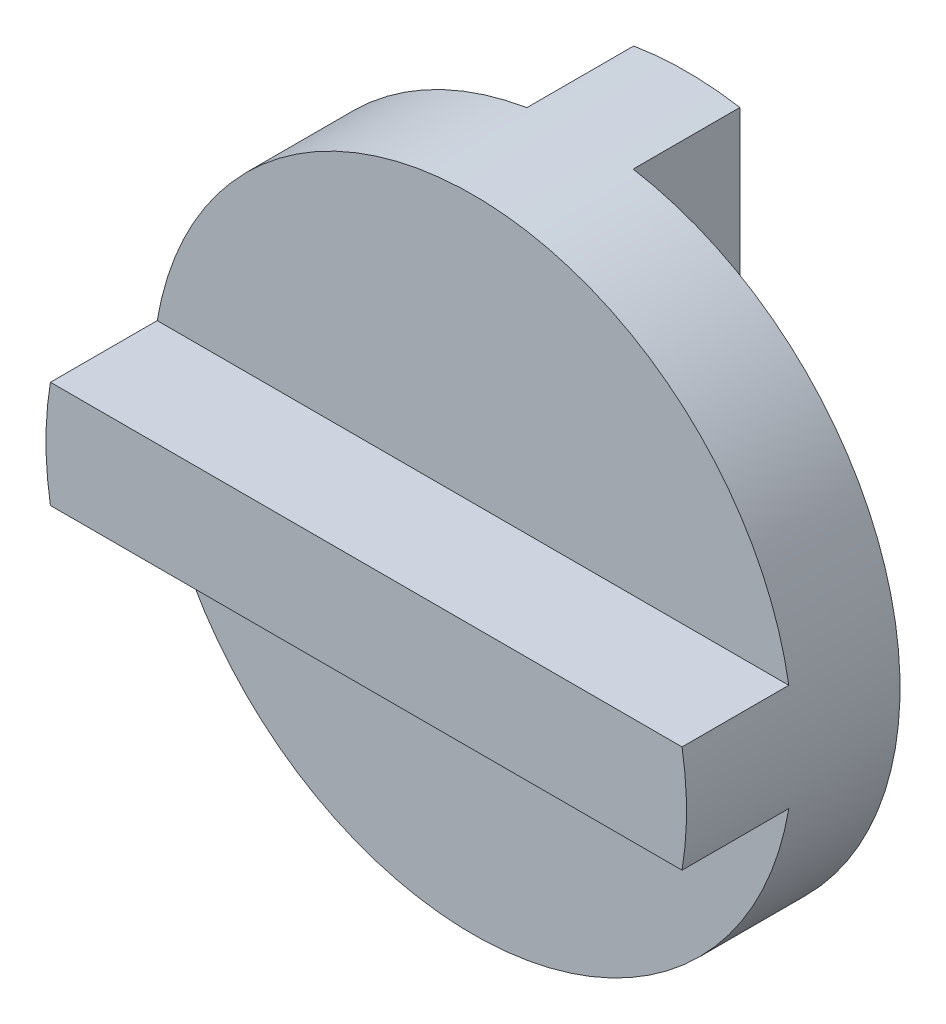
ISO-10303-21;
HEADER;
FILE_DESCRIPTION(('STEP AP214'),'2;1');
FILE_NAME('part.step','',(''),(''),'','','');
FILE_SCHEMA(('AUTOMOTIVE_DESIGN { 1 0 10303 214 1 1 1 1 }'));
ENDSEC;
DATA;
#1=APPLICATION_CONTEXT('core data for automotive mechanical design processes');
#2=APPLICATION_PROTOCOL_DEFINITION('international standard','automotive_design',2000,#1);
#3=PRODUCT_CONTEXT('',#1,'mechanical');
#4=PRODUCT('Part','Part','',(#3));
#5=PRODUCT_RELATED_PRODUCT_CATEGORY('part','',(#4));
#6=PRODUCT_DEFINITION_FORMATION('','',#4);
#7=PRODUCT_DEFINITION_CONTEXT('part definition',#1,'design');
#8=PRODUCT_DEFINITION('design','',#6,#7);
#9=PRODUCT_DEFINITION_SHAPE('','',#8);
#10=(LENGTH_UNIT() NAMED_UNIT(*) SI_UNIT(.MILLI.,.METRE.));
#11=(NAMED_UNIT(*) PLANE_ANGLE_UNIT() SI_UNIT($,.RADIAN.));
#12=(NAMED_UNIT(*) SI_UNIT($,.STERADIAN.) SOLID_ANGLE_UNIT());
#13=UNCERTAINTY_MEASURE_WITH_UNIT(LENGTH_MEASURE(1.E-05),#10,'distance_accuracy_value','');
#14=(GEOMETRIC_REPRESENTATION_CONTEXT(3) GLOBAL_UNCERTAINTY_ASSIGNED_CONTEXT((#13)) GLOBAL_UNIT_ASSIGNED_CONTEXT((#10,
#11,#12)) REPRESENTATION_CONTEXT('',''));
#15=CARTESIAN_POINT('',(0.,0.,0.));
#16=DIRECTION('',(0.,0.,1.));
#17=DIRECTION('',(1.,0.,0.));
#18=AXIS2_PLACEMENT_3D('',#15,#16,#17);
#19=CARTESIAN_POINT('',(0.,0.,0.));
#20=DIRECTION('',(0.,0.,1.));
#21=DIRECTION('',(1.,0.,0.));
#22=AXIS2_PLACEMENT_3D('',#19,#20,#21);
#23=PLANE('',#22);
#24=DIRECTION('',(0.,1.,0.));
#25=VECTOR('',#24,1.);
#26=CARTESIAN_POINT('',(-4.95607863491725,29.587789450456,0.));
#27=LINE('',#26,#25);
#28=CARTESIAN_POINT('',(-4.95607863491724,-29.587789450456,0.));
#29=VERTEX_POINT('',#28);
#30=CARTESIAN_POINT('',(-4.95607863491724,29.587789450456,0.));
#31=VERTEX_POINT('',#30);
#32=EDGE_CURVE('E48',#29,#31,#27,.T.);
#33=ORIENTED_EDGE('',*,*,#32,.F.);
#34=CARTESIAN_POINT('',(0.,0.,0.));
#35=DIRECTION('',(0.,0.,1.));
#36=DIRECTION('',(1.,0.,0.));
#37=AXIS2_PLACEMENT_3D('',#34,#35,#36);
#38=CIRCLE('',#37,30.);
#39=EDGE_CURVE('E51',#31,#29,#38,.T.);
#40=ORIENTED_EDGE('',*,*,#39,.F.);
#41=EDGE_LOOP('',(#33,#40));
#42=FACE_BOUND('',#41,.T.);
#43=ADVANCED_FACE('F32',(#42),#23,.F.);
#44=DIRECTION('',(0.,-1.,0.));
#45=VECTOR('',#44,1.);
#46=CARTESIAN_POINT('',(4.99999999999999,29.5803989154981,0.));
#47=LINE('',#46,#45);
#48=CARTESIAN_POINT('',(4.99999999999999,29.5803989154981,0.));
#49=VERTEX_POINT('',#48);
#50=CARTESIAN_POINT('',(4.99999999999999,-29.5803989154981,0.));
#51=VERTEX_POINT('',#50);
#52=EDGE_CURVE('E129',#49,#51,#47,.T.);
#53=ORIENTED_EDGE('',*,*,#52,.F.);
#54=EDGE_CURVE('E110',#51,#49,#38,.T.);
#55=ORIENTED_EDGE('',*,*,#54,.F.);
#56=EDGE_LOOP('',(#53,#55));
#57=FACE_BOUND('',#56,.T.);
#58=ADVANCED_FACE('F207',(#57),#23,.F.);
#59=CARTESIAN_POINT('',(0.,0.,10.));
#60=DIRECTION('',(0.,0.,1.));
#61=DIRECTION('',(1.,0.,0.));
#62=AXIS2_PLACEMENT_3D('',#59,#60,#61);
#63=PLANE('',#62);
#64=DIRECTION('',(1.,0.,0.));
#65=VECTOR('',#64,1.);
#66=CARTESIAN_POINT('',(29.5803989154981,-5.00000000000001,10.));
#67=LINE('',#66,#65);
#68=CARTESIAN_POINT('',(-29.5803989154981,-5.00000000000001,10.));
#69=VERTEX_POINT('',#68);
#70=CARTESIAN_POINT('',(29.5803989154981,-5.00000000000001,10.));
#71=VERTEX_POINT('',#70);
#72=EDGE_CURVE('E113',#69,#71,#67,.T.);
#73=ORIENTED_EDGE('',*,*,#72,.F.);
#74=CARTESIAN_POINT('',(0.,0.,10.));
#75=DIRECTION('',(0.,0.,1.));
#76=DIRECTION('',(1.,0.,0.));
#77=AXIS2_PLACEMENT_3D('',#74,#75,#76);
#78=CIRCLE('',#77,30.);
#79=EDGE_CURVE('E41',#69,#71,#78,.T.);
#80=ORIENTED_EDGE('',*,*,#79,.T.);
#81=EDGE_LOOP('',(#73,#80));
#82=FACE_BOUND('',#81,.T.);
#83=ADVANCED_FACE('F199',(#82),#63,.T.);
#84=CARTESIAN_POINT('',(0.,0.,10.));
#85=DIRECTION('',(0.,0.,-1.));
#86=DIRECTION('',(-1.,0.,0.));
#87=AXIS2_PLACEMENT_3D('',#84,#85,#86);
#88=CYLINDRICAL_SURFACE('',#87,30.);
#89=CARTESIAN_POINT('',(29.5803989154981,5.,10.));
#90=VERTEX_POINT('',#89);
#91=CARTESIAN_POINT('',(-29.5803989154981,5.,10.));
#92=VERTEX_POINT('',#91);
#93=EDGE_CURVE('E11',#90,#92,#78,.T.);
#94=ORIENTED_EDGE('',*,*,#93,.F.);
#95=DIRECTION('',(0.,0.,-1.));
#96=VECTOR('',#95,1.);
#97=CARTESIAN_POINT('',(29.5803989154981,5.,20.));
#98=LINE('',#97,#96);
#99=CARTESIAN_POINT('',(29.5803989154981,5.,20.));
#100=VERTEX_POINT('',#99);
#101=EDGE_CURVE('E161',#100,#90,#98,.T.);
#102=ORIENTED_EDGE('',*,*,#101,.F.);
#103=CARTESIAN_POINT('',(0.,0.,20.));
#104=DIRECTION('',(0.,0.,1.));
#105=DIRECTION('',(-1.,0.,0.));
#106=AXIS2_PLACEMENT_3D('',#103,#104,#105);
#107=CIRCLE('',#106,30.);
#108=CARTESIAN_POINT('',(29.5803989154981,-5.00000000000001,20.));
#109=VERTEX_POINT('',#108);
#110=EDGE_CURVE('E193',#109,#100,#107,.T.);
#111=ORIENTED_EDGE('',*,*,#110,.F.);
#112=DIRECTION('',(0.,0.,-1.));
#113=VECTOR('',#112,1.);
#114=CARTESIAN_POINT('',(29.5803989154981,-5.00000000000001,20.));
#115=LINE('',#114,#113);
#116=EDGE_CURVE('E156',#109,#71,#115,.T.);
#117=ORIENTED_EDGE('',*,*,#116,.T.);
#118=ORIENTED_EDGE('',*,*,#79,.F.);
#119=DIRECTION('',(0.,0.,-1.));
#120=VECTOR('',#119,1.);
#121=CARTESIAN_POINT('',(-29.5803989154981,-5.00000000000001,20.));
#122=LINE('',#121,#120);
#123=CARTESIAN_POINT('',(-29.5803989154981,-5.00000000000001,20.));
#124=VERTEX_POINT('',#123);
#125=EDGE_CURVE('E148',#124,#69,#122,.T.);
#126=ORIENTED_EDGE('',*,*,#125,.F.);
#127=CARTESIAN_POINT('',(-7.15746906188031E-12,-5.90239662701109E-13,20.));
#128=DIRECTION('',(0.,0.,1.));
#129=DIRECTION('',(1.,0.,0.));
#130=AXIS2_PLACEMENT_3D('',#127,#128,#129);
#131=CIRCLE('',#130,29.9999999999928);
#132=CARTESIAN_POINT('',(-29.5803989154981,5.,20.));
#133=VERTEX_POINT('',#132);
#134=EDGE_CURVE('E178',#133,#124,#131,.T.);
#135=ORIENTED_EDGE('',*,*,#134,.F.);
#136=DIRECTION('',(0.,0.,-1.));
#137=VECTOR('',#136,1.);
#138=CARTESIAN_POINT('',(-29.5803989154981,5.,20.));
#139=LINE('',#138,#137);
#140=EDGE_CURVE('E179',#133,#92,#139,.T.);
#141=ORIENTED_EDGE('',*,*,#140,.T.);
#142=EDGE_LOOP('',(#94,#102,#111,#117,#118,#126,#135,#141));
#143=FACE_BOUND('',#142,.T.);
#144=ORIENTED_EDGE('',*,*,#54,.T.);
#145=DIRECTION('',(0.,0.,1.));
#146=VECTOR('',#145,1.);
#147=CARTESIAN_POINT('',(5.,29.5803989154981,-10.));
#148=LINE('',#147,#146);
#149=CARTESIAN_POINT('',(5.,29.5803989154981,-10.));
#150=VERTEX_POINT('',#149);
#151=EDGE_CURVE('E108',#150,#49,#148,.T.);
#152=ORIENTED_EDGE('',*,*,#151,.F.);
#153=CARTESIAN_POINT('',(0.,9.64506252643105E-13,-10.));
#154=DIRECTION('',(0.,0.,-1.));
#155=DIRECTION('',(1.,0.,0.));
#156=AXIS2_PLACEMENT_3D('',#153,#154,#155);
#157=CIRCLE('',#156,29.999999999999);
#158=CARTESIAN_POINT('',(-4.95607863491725,29.587789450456,-10.));
#159=VERTEX_POINT('',#158);
#160=EDGE_CURVE('E94',#159,#150,#157,.T.);
#161=ORIENTED_EDGE('',*,*,#160,.F.);
#162=DIRECTION('',(0.,0.,1.));
#163=VECTOR('',#162,1.);
#164=CARTESIAN_POINT('',(-4.95607863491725,29.587789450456,-10.));
#165=LINE('',#164,#163);
#166=EDGE_CURVE('E123',#159,#31,#165,.T.);
#167=ORIENTED_EDGE('',*,*,#166,.T.);
#168=ORIENTED_EDGE('',*,*,#39,.T.);
#169=DIRECTION('',(0.,0.,1.));
#170=VECTOR('',#169,1.);
#171=CARTESIAN_POINT('',(-4.95607863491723,-29.587789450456,-10.));
#172=LINE('',#171,#170);
#173=CARTESIAN_POINT('',(-4.95607863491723,-29.587789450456,-10.));
#174=VERTEX_POINT('',#173);
#175=EDGE_CURVE('E135',#174,#29,#172,.T.);
#176=ORIENTED_EDGE('',*,*,#175,.F.);
#177=CARTESIAN_POINT('',(0.,2.35922392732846E-13,-10.));
#178=DIRECTION('',(0.,0.,-1.));
#179=DIRECTION('',(1.,0.,0.));
#180=AXIS2_PLACEMENT_3D('',#177,#178,#179);
#181=CIRCLE('',#180,30.0000000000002);
#182=CARTESIAN_POINT('',(4.99999999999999,-29.5803989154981,-10.));
#183=VERTEX_POINT('',#182);
#184=EDGE_CURVE('E118',#183,#174,#181,.T.);
#185=ORIENTED_EDGE('',*,*,#184,.F.);
#186=DIRECTION('',(0.,0.,1.));
#187=VECTOR('',#186,1.);
#188=CARTESIAN_POINT('',(4.99999999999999,-29.5803989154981,-10.));
#189=LINE('',#188,#187);
#190=EDGE_CURVE('E114',#183,#51,#189,.T.);
#191=ORIENTED_EDGE('',*,*,#190,.T.);
#192=EDGE_LOOP('',(#144,#152,#161,#167,#168,#176,#185,#191));
#193=FACE_BOUND('',#192,.T.);
#194=ADVANCED_FACE('F34',(#143,#193),#88,.T.);
#195=DIRECTION('',(-1.,0.,0.));
#196=VECTOR('',#195,1.);
#197=CARTESIAN_POINT('',(-29.5803989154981,5.,10.));
#198=LINE('',#197,#196);
#199=EDGE_CURVE('E165',#90,#92,#198,.T.);
#200=ORIENTED_EDGE('',*,*,#199,.F.);
#201=ORIENTED_EDGE('',*,*,#93,.T.);
#202=EDGE_LOOP('',(#200,#201));
#203=FACE_BOUND('',#202,.T.);
#204=ADVANCED_FACE('F195',(#203),#63,.T.);
#205=CARTESIAN_POINT('',(29.5803989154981,-5.00000000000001,20.));
#206=DIRECTION('',(0.,1.,0.));
#207=DIRECTION('',(0.,0.,1.));
#208=AXIS2_PLACEMENT_3D('',#205,#206,#207);
#209=PLANE('',#208);
#210=ORIENTED_EDGE('',*,*,#72,.T.);
#211=ORIENTED_EDGE('',*,*,#116,.F.);
#212=DIRECTION('',(1.,0.,0.));
#213=VECTOR('',#212,1.);
#214=CARTESIAN_POINT('',(29.5803989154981,-5.00000000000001,20.));
#215=LINE('',#214,#213);
#216=EDGE_CURVE('E314',#124,#109,#215,.T.);
#217=ORIENTED_EDGE('',*,*,#216,.F.);
#218=ORIENTED_EDGE('',*,*,#125,.T.);
#219=EDGE_LOOP('',(#210,#211,#217,#218));
#220=FACE_BOUND('',#219,.T.);
#221=ADVANCED_FACE('F197',(#220),#209,.F.);
#222=CARTESIAN_POINT('',(-29.5803989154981,5.,20.));
#223=DIRECTION('',(0.,-1.,0.));
#224=DIRECTION('',(0.,0.,-1.));
#225=AXIS2_PLACEMENT_3D('',#222,#223,#224);
#226=PLANE('',#225);
#227=ORIENTED_EDGE('',*,*,#199,.T.);
#228=ORIENTED_EDGE('',*,*,#140,.F.);
#229=DIRECTION('',(-1.,0.,0.));
#230=VECTOR('',#229,1.);
#231=CARTESIAN_POINT('',(-29.5803989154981,5.,20.));
#232=LINE('',#231,#230);
#233=EDGE_CURVE('E171',#100,#133,#232,.T.);
#234=ORIENTED_EDGE('',*,*,#233,.F.);
#235=ORIENTED_EDGE('',*,*,#101,.T.);
#236=EDGE_LOOP('',(#227,#228,#234,#235));
#237=FACE_BOUND('',#236,.T.);
#238=ADVANCED_FACE('F187',(#237),#226,.F.);
#239=CARTESIAN_POINT('',(-7.15746906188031E-12,-5.90239662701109E-13,20.));
#240=DIRECTION('',(0.,0.,1.));
#241=DIRECTION('',(1.,0.,0.));
#242=AXIS2_PLACEMENT_3D('',#239,#240,#241);
#243=PLANE('',#242);
#244=ORIENTED_EDGE('',*,*,#134,.T.);
#245=ORIENTED_EDGE('',*,*,#216,.T.);
#246=ORIENTED_EDGE('',*,*,#110,.T.);
#247=ORIENTED_EDGE('',*,*,#233,.T.);
#248=EDGE_LOOP('',(#244,#245,#246,#247));
#249=FACE_BOUND('',#248,.T.);
#250=ADVANCED_FACE('F234',(#249),#243,.T.);
#251=CARTESIAN_POINT('',(4.99999999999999,29.5803989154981,-10.));
#252=DIRECTION('',(-1.,0.,0.));
#253=DIRECTION('',(0.,0.,1.));
#254=AXIS2_PLACEMENT_3D('',#251,#252,#253);
#255=PLANE('',#254);
#256=ORIENTED_EDGE('',*,*,#52,.T.);
#257=ORIENTED_EDGE('',*,*,#190,.F.);
#258=DIRECTION('',(0.,-1.,0.));
#259=VECTOR('',#258,1.);
#260=CARTESIAN_POINT('',(4.99999999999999,29.5803989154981,-10.));
#261=LINE('',#260,#259);
#262=EDGE_CURVE('E98',#150,#183,#261,.T.);
#263=ORIENTED_EDGE('',*,*,#262,.F.);
#264=ORIENTED_EDGE('',*,*,#151,.T.);
#265=EDGE_LOOP('',(#256,#257,#263,#264));
#266=FACE_BOUND('',#265,.T.);
#267=ADVANCED_FACE('F116',(#266),#255,.F.);
#268=CARTESIAN_POINT('',(-4.95607863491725,29.587789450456,-10.));
#269=DIRECTION('',(1.,0.,0.));
#270=DIRECTION('',(0.,0.,-1.));
#271=AXIS2_PLACEMENT_3D('',#268,#269,#270);
#272=PLANE('',#271);
#273=ORIENTED_EDGE('',*,*,#32,.T.);
#274=ORIENTED_EDGE('',*,*,#166,.F.);
#275=DIRECTION('',(0.,1.,0.));
#276=VECTOR('',#275,1.);
#277=CARTESIAN_POINT('',(-4.95607863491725,29.587789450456,-10.));
#278=LINE('',#277,#276);
#279=EDGE_CURVE('E101',#174,#159,#278,.T.);
#280=ORIENTED_EDGE('',*,*,#279,.F.);
#281=ORIENTED_EDGE('',*,*,#175,.T.);
#282=EDGE_LOOP('',(#273,#274,#280,#281));
#283=FACE_BOUND('',#282,.T.);
#284=ADVANCED_FACE('F146',(#283),#272,.F.);
#285=CARTESIAN_POINT('',(0.,9.64506252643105E-13,-10.));
#286=DIRECTION('',(0.,0.,1.));
#287=DIRECTION('',(1.,0.,0.));
#288=AXIS2_PLACEMENT_3D('',#285,#286,#287);
#289=PLANE('',#288);
#290=ORIENTED_EDGE('',*,*,#160,.T.);
#291=ORIENTED_EDGE('',*,*,#262,.T.);
#292=ORIENTED_EDGE('',*,*,#184,.T.);
#293=ORIENTED_EDGE('',*,*,#279,.T.);
#294=EDGE_LOOP('',(#290,#291,#292,#293));
#295=FACE_BOUND('',#294,.T.);
#296=ADVANCED_FACE('F96',(#295),#289,.F.);
#297=CLOSED_SHELL('',(#43,#58,#83,#194,#204,#221,#238,#250,#267,#284,#296));
#298=MANIFOLD_SOLID_BREP('B2',#297);
#299=ADVANCED_BREP_SHAPE_REPRESENTATION('',(#18,#298),#14);
#300=SHAPE_DEFINITION_REPRESENTATION(#9,#299);
ENDSEC;
END-ISO-10303-21;
